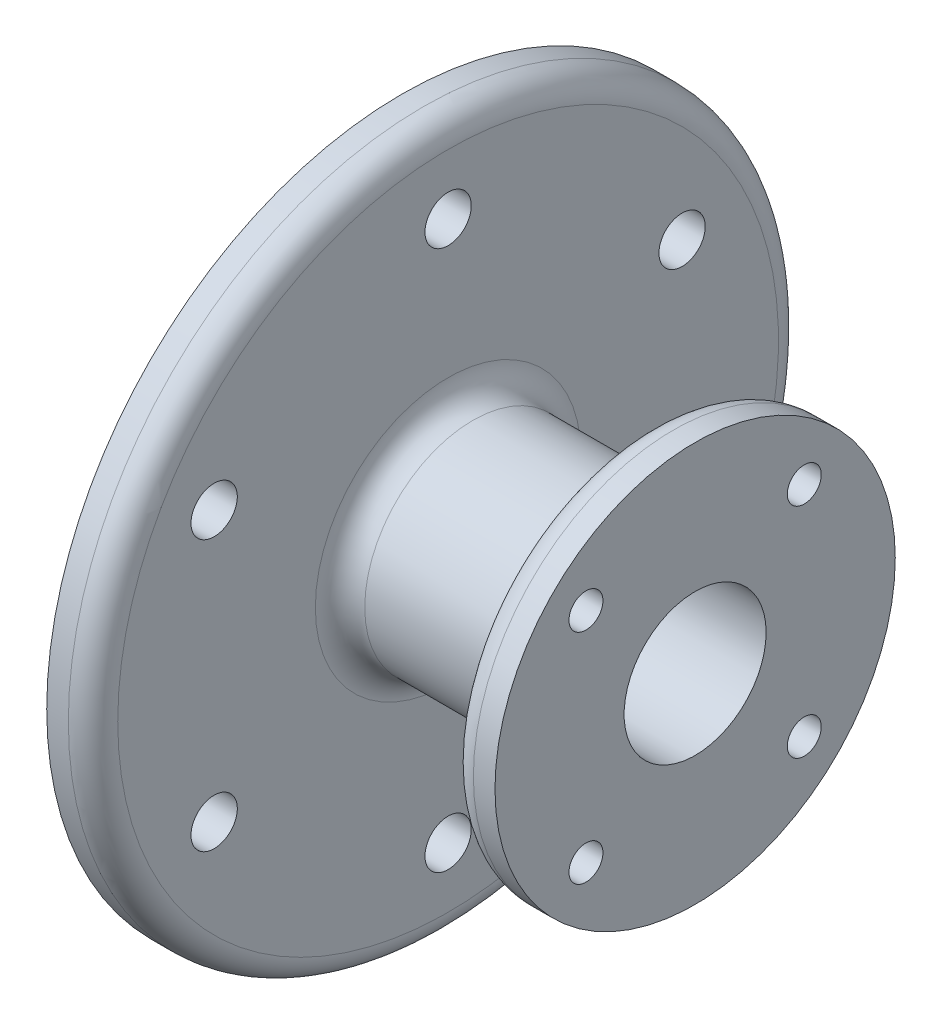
ISO-10303-21;
HEADER;
FILE_DESCRIPTION(('STEP AP214'),'2;1');
FILE_NAME('part.step','',(''),(''),'','','');
FILE_SCHEMA(('AUTOMOTIVE_DESIGN { 1 0 10303 214 1 1 1 1 }'));
ENDSEC;
DATA;
#1=APPLICATION_CONTEXT('core data for automotive mechanical design processes');
#2=APPLICATION_PROTOCOL_DEFINITION('international standard','automotive_design',2000,#1);
#3=PRODUCT_CONTEXT('',#1,'mechanical');
#4=PRODUCT('Part','Part','',(#3));
#5=PRODUCT_RELATED_PRODUCT_CATEGORY('part','',(#4));
#6=PRODUCT_DEFINITION_FORMATION('','',#4);
#7=PRODUCT_DEFINITION_CONTEXT('part definition',#1,'design');
#8=PRODUCT_DEFINITION('design','',#6,#7);
#9=PRODUCT_DEFINITION_SHAPE('','',#8);
#10=(LENGTH_UNIT() NAMED_UNIT(*) SI_UNIT(.MILLI.,.METRE.));
#11=(NAMED_UNIT(*) PLANE_ANGLE_UNIT() SI_UNIT($,.RADIAN.));
#12=(NAMED_UNIT(*) SI_UNIT($,.STERADIAN.) SOLID_ANGLE_UNIT());
#13=UNCERTAINTY_MEASURE_WITH_UNIT(LENGTH_MEASURE(1.E-05),#10,'distance_accuracy_value','');
#14=(GEOMETRIC_REPRESENTATION_CONTEXT(3) GLOBAL_UNCERTAINTY_ASSIGNED_CONTEXT((#13)) GLOBAL_UNIT_ASSIGNED_CONTEXT((#10,
#11,#12)) REPRESENTATION_CONTEXT('',''));
#15=CARTESIAN_POINT('',(0.,0.,0.));
#16=DIRECTION('',(0.,0.,1.));
#17=DIRECTION('',(1.,0.,0.));
#18=AXIS2_PLACEMENT_3D('',#15,#16,#17);
#19=CARTESIAN_POINT('',(-168.,-154.824455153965,0.));
#20=DIRECTION('',(1.,0.,0.));
#21=DIRECTION('',(0.,0.,-1.));
#22=AXIS2_PLACEMENT_3D('',#19,#20,#21);
#23=PLANE('',#22);
#24=CARTESIAN_POINT('',(-168.,-54.6446609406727,-35.3553390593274));
#25=DIRECTION('',(-1.,0.,0.));
#26=DIRECTION('',(0.,0.,1.));
#27=AXIS2_PLACEMENT_3D('',#24,#25,#26);
#28=CIRCLE('',#27,5.49999999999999);
#29=CARTESIAN_POINT('',(-168.,-54.6446609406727,-29.8553390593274));
#30=VERTEX_POINT('',#29);
#31=EDGE_CURVE('E102',#30,#30,#28,.T.);
#32=ORIENTED_EDGE('',*,*,#31,.F.);
#33=EDGE_LOOP('',(#32));
#34=FACE_BOUND('',#33,.T.);
#35=CARTESIAN_POINT('',(-168.,-54.6446609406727,35.3553390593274));
#36=DIRECTION('',(-1.,0.,0.));
#37=DIRECTION('',(0.,0.,1.));
#38=AXIS2_PLACEMENT_3D('',#35,#36,#37);
#39=CIRCLE('',#38,5.49999999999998);
#40=CARTESIAN_POINT('',(-168.,-54.6446609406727,40.8553390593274));
#41=VERTEX_POINT('',#40);
#42=EDGE_CURVE('E96',#41,#41,#39,.T.);
#43=ORIENTED_EDGE('',*,*,#42,.F.);
#44=EDGE_LOOP('',(#43));
#45=FACE_BOUND('',#44,.T.);
#46=CARTESIAN_POINT('',(-168.,-125.355339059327,35.3553390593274));
#47=DIRECTION('',(-1.,0.,0.));
#48=DIRECTION('',(0.,0.,1.));
#49=AXIS2_PLACEMENT_3D('',#46,#47,#48);
#50=CIRCLE('',#49,5.49999999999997);
#51=CARTESIAN_POINT('',(-168.,-125.355339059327,40.8553390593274));
#52=VERTEX_POINT('',#51);
#53=EDGE_CURVE('E90',#52,#52,#50,.T.);
#54=ORIENTED_EDGE('',*,*,#53,.F.);
#55=EDGE_LOOP('',(#54));
#56=FACE_BOUND('',#55,.T.);
#57=CARTESIAN_POINT('',(-168.,-125.355339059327,-35.3553390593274));
#58=DIRECTION('',(-1.,0.,0.));
#59=DIRECTION('',(0.,0.,1.));
#60=AXIS2_PLACEMENT_3D('',#57,#58,#59);
#61=CIRCLE('',#60,5.49999999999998);
#62=CARTESIAN_POINT('',(-168.,-125.355339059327,-29.8553390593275));
#63=VERTEX_POINT('',#62);
#64=EDGE_CURVE('E84',#63,#63,#61,.T.);
#65=ORIENTED_EDGE('',*,*,#64,.F.);
#66=EDGE_LOOP('',(#65));
#67=FACE_BOUND('',#66,.T.);
#68=CARTESIAN_POINT('',(-168.,-90.,0.));
#69=DIRECTION('',(1.,0.,0.));
#70=DIRECTION('',(0.,0.,-1.));
#71=AXIS2_PLACEMENT_3D('',#68,#69,#70);
#72=CIRCLE('',#71,43.);
#73=CARTESIAN_POINT('',(-168.,-90.,-43.));
#74=VERTEX_POINT('',#73);
#75=EDGE_CURVE('E43',#74,#74,#72,.T.);
#76=ORIENTED_EDGE('',*,*,#75,.T.);
#77=EDGE_LOOP('',(#76));
#78=FACE_BOUND('',#77,.T.);
#79=CARTESIAN_POINT('',(-168.,-90.,0.));
#80=DIRECTION('',(1.,0.,0.));
#81=DIRECTION('',(0.,0.,-1.));
#82=AXIS2_PLACEMENT_3D('',#79,#80,#81);
#83=CIRCLE('',#82,56.8244551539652);
#84=CARTESIAN_POINT('',(-168.,-90.,-56.8244551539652));
#85=VERTEX_POINT('',#84);
#86=EDGE_CURVE('E48',#85,#85,#83,.F.);
#87=ORIENTED_EDGE('',*,*,#86,.T.);
#88=EDGE_LOOP('',(#87));
#89=FACE_BOUND('',#88,.T.);
#90=ADVANCED_FACE('F28',(#34,#45,#56,#67,#78,#89),#23,.F.);
#91=CARTESIAN_POINT('',(-121.019521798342,-90.,0.));
#92=DIRECTION('',(1.,0.,0.));
#93=DIRECTION('',(0.,0.,-1.));
#94=AXIS2_PLACEMENT_3D('',#91,#92,#93);
#95=CYLINDRICAL_SURFACE('',#94,64.8244551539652);
#96=CARTESIAN_POINT('',(-160.,-90.,0.));
#97=DIRECTION('',(1.,0.,0.));
#98=DIRECTION('',(0.,0.,-1.));
#99=AXIS2_PLACEMENT_3D('',#96,#97,#98);
#100=CIRCLE('',#99,64.8244551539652);
#101=CARTESIAN_POINT('',(-160.,-90.,-64.8244551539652));
#102=VERTEX_POINT('',#101);
#103=EDGE_CURVE('E39',#102,#102,#100,.T.);
#104=ORIENTED_EDGE('',*,*,#103,.T.);
#105=EDGE_LOOP('',(#104));
#106=FACE_BOUND('',#105,.T.);
#107=CARTESIAN_POINT('',(-153.,-90.,0.));
#108=DIRECTION('',(1.,0.,0.));
#109=DIRECTION('',(0.,0.,-1.));
#110=AXIS2_PLACEMENT_3D('',#107,#108,#109);
#111=CIRCLE('',#110,64.8244551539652);
#112=CARTESIAN_POINT('',(-153.,-90.,-64.8244551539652));
#113=VERTEX_POINT('',#112);
#114=EDGE_CURVE('E66',#113,#113,#111,.T.);
#115=ORIENTED_EDGE('',*,*,#114,.F.);
#116=EDGE_LOOP('',(#115));
#117=FACE_BOUND('',#116,.T.);
#118=ADVANCED_FACE('F174',(#106,#117),#95,.T.);
#119=CARTESIAN_POINT('',(-153.,-113.,0.));
#120=DIRECTION('',(-1.,0.,0.));
#121=DIRECTION('',(0.,0.,1.));
#122=AXIS2_PLACEMENT_3D('',#119,#120,#121);
#123=PLANE('',#122);
#124=CARTESIAN_POINT('',(-153.,-54.6446609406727,-35.3553390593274));
#125=DIRECTION('',(-1.,0.,0.));
#126=DIRECTION('',(0.,0.,1.));
#127=AXIS2_PLACEMENT_3D('',#124,#125,#126);
#128=CIRCLE('',#127,5.49999999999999);
#129=CARTESIAN_POINT('',(-153.,-54.6446609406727,-29.8553390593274));
#130=VERTEX_POINT('',#129);
#131=EDGE_CURVE('E99',#130,#130,#128,.F.);
#132=ORIENTED_EDGE('',*,*,#131,.F.);
#133=EDGE_LOOP('',(#132));
#134=FACE_BOUND('',#133,.T.);
#135=CARTESIAN_POINT('',(-153.,-54.6446609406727,35.3553390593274));
#136=DIRECTION('',(-1.,0.,0.));
#137=DIRECTION('',(0.,0.,1.));
#138=AXIS2_PLACEMENT_3D('',#135,#136,#137);
#139=CIRCLE('',#138,5.49999999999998);
#140=CARTESIAN_POINT('',(-153.,-54.6446609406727,40.8553390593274));
#141=VERTEX_POINT('',#140);
#142=EDGE_CURVE('E93',#141,#141,#139,.F.);
#143=ORIENTED_EDGE('',*,*,#142,.F.);
#144=EDGE_LOOP('',(#143));
#145=FACE_BOUND('',#144,.T.);
#146=CARTESIAN_POINT('',(-153.,-125.355339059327,35.3553390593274));
#147=DIRECTION('',(-1.,0.,0.));
#148=DIRECTION('',(0.,0.,1.));
#149=AXIS2_PLACEMENT_3D('',#146,#147,#148);
#150=CIRCLE('',#149,5.49999999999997);
#151=CARTESIAN_POINT('',(-153.,-125.355339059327,40.8553390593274));
#152=VERTEX_POINT('',#151);
#153=EDGE_CURVE('E87',#152,#152,#150,.F.);
#154=ORIENTED_EDGE('',*,*,#153,.F.);
#155=EDGE_LOOP('',(#154));
#156=FACE_BOUND('',#155,.T.);
#157=CARTESIAN_POINT('',(-153.,-125.355339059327,-35.3553390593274));
#158=DIRECTION('',(-1.,0.,0.));
#159=DIRECTION('',(0.,0.,1.));
#160=AXIS2_PLACEMENT_3D('',#157,#158,#159);
#161=CIRCLE('',#160,5.49999999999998);
#162=CARTESIAN_POINT('',(-153.,-125.355339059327,-29.8553390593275));
#163=VERTEX_POINT('',#162);
#164=EDGE_CURVE('E81',#163,#163,#161,.F.);
#165=ORIENTED_EDGE('',*,*,#164,.F.);
#166=EDGE_LOOP('',(#165));
#167=FACE_BOUND('',#166,.T.);
#168=CARTESIAN_POINT('',(-153.,-90.,0.));
#169=DIRECTION('',(1.,0.,0.));
#170=DIRECTION('',(0.,0.,-1.));
#171=AXIS2_PLACEMENT_3D('',#168,#169,#170);
#172=CIRCLE('',#171,23.);
#173=CARTESIAN_POINT('',(-153.,-90.,-23.));
#174=VERTEX_POINT('',#173);
#175=EDGE_CURVE('E69',#174,#174,#172,.T.);
#176=ORIENTED_EDGE('',*,*,#175,.F.);
#177=EDGE_LOOP('',(#176));
#178=FACE_BOUND('',#177,.T.);
#179=ORIENTED_EDGE('',*,*,#114,.T.);
#180=EDGE_LOOP('',(#179));
#181=FACE_BOUND('',#180,.T.);
#182=ADVANCED_FACE('F180',(#134,#145,#156,#167,#178,#181),#123,.F.);
#183=CARTESIAN_POINT('',(-121.019521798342,-90.,0.));
#184=DIRECTION('',(1.,0.,0.));
#185=DIRECTION('',(0.,0.,-1.));
#186=AXIS2_PLACEMENT_3D('',#183,#184,#185);
#187=CYLINDRICAL_SURFACE('',#186,23.);
#188=CARTESIAN_POINT('',(-263.,-90.,0.));
#189=DIRECTION('',(1.,0.,0.));
#190=DIRECTION('',(0.,0.,-1.));
#191=AXIS2_PLACEMENT_3D('',#188,#189,#190);
#192=CIRCLE('',#191,23.);
#193=CARTESIAN_POINT('',(-263.,-90.,-23.));
#194=VERTEX_POINT('',#193);
#195=EDGE_CURVE('E72',#194,#194,#192,.T.);
#196=ORIENTED_EDGE('',*,*,#195,.F.);
#197=EDGE_LOOP('',(#196));
#198=FACE_BOUND('',#197,.T.);
#199=ORIENTED_EDGE('',*,*,#175,.T.);
#200=EDGE_LOOP('',(#199));
#201=FACE_BOUND('',#200,.T.);
#202=ADVANCED_FACE('F171',(#198,#201),#187,.F.);
#203=CARTESIAN_POINT('',(-263.,-113.,0.));
#204=DIRECTION('',(1.,0.,0.));
#205=DIRECTION('',(0.,0.,-1.));
#206=AXIS2_PLACEMENT_3D('',#203,#204,#205);
#207=PLANE('',#206);
#208=CARTESIAN_POINT('',(-263.,-90.,0.));
#209=DIRECTION('',(1.,0.,0.));
#210=DIRECTION('',(0.,0.,-1.));
#211=AXIS2_PLACEMENT_3D('',#208,#209,#210);
#212=CIRCLE('',#211,28.);
#213=CARTESIAN_POINT('',(-263.,-90.,-28.));
#214=VERTEX_POINT('',#213);
#215=EDGE_CURVE('E10',#214,#214,#212,.F.);
#216=ORIENTED_EDGE('',*,*,#215,.T.);
#217=EDGE_LOOP('',(#216));
#218=FACE_BOUND('',#217,.T.);
#219=ORIENTED_EDGE('',*,*,#195,.T.);
#220=EDGE_LOOP('',(#219));
#221=FACE_BOUND('',#220,.T.);
#222=ADVANCED_FACE('F166',(#218,#221),#207,.F.);
#223=CARTESIAN_POINT('',(-121.019521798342,-90.,0.));
#224=DIRECTION('',(1.,0.,0.));
#225=DIRECTION('',(0.,0.,-1.));
#226=AXIS2_PLACEMENT_3D('',#223,#224,#225);
#227=CYLINDRICAL_SURFACE('',#226,31.);
#228=CARTESIAN_POINT('',(-260.,-90.,0.));
#229=DIRECTION('',(1.,0.,0.));
#230=DIRECTION('',(0.,0.,-1.));
#231=AXIS2_PLACEMENT_3D('',#228,#229,#230);
#232=CIRCLE('',#231,31.);
#233=CARTESIAN_POINT('',(-260.,-90.,-31.));
#234=VERTEX_POINT('',#233);
#235=EDGE_CURVE('E35',#234,#234,#232,.T.);
#236=ORIENTED_EDGE('',*,*,#235,.T.);
#237=EDGE_LOOP('',(#236));
#238=FACE_BOUND('',#237,.T.);
#239=CARTESIAN_POINT('',(-248.,-90.,0.));
#240=DIRECTION('',(1.,0.,0.));
#241=DIRECTION('',(0.,0.,-1.));
#242=AXIS2_PLACEMENT_3D('',#239,#240,#241);
#243=CIRCLE('',#242,31.);
#244=CARTESIAN_POINT('',(-248.,-90.,-31.));
#245=VERTEX_POINT('',#244);
#246=EDGE_CURVE('E75',#245,#245,#243,.T.);
#247=ORIENTED_EDGE('',*,*,#246,.F.);
#248=EDGE_LOOP('',(#247));
#249=FACE_BOUND('',#248,.T.);
#250=ADVANCED_FACE('F149',(#238,#249),#227,.T.);
#251=CARTESIAN_POINT('',(-248.,-205.,0.));
#252=DIRECTION('',(1.,0.,0.));
#253=DIRECTION('',(0.,0.,-1.));
#254=AXIS2_PLACEMENT_3D('',#251,#252,#253);
#255=PLANE('',#254);
#256=CARTESIAN_POINT('',(-248.,-46.2499999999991,-75.7772228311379));
#257=DIRECTION('',(-1.,0.,0.));
#258=DIRECTION('',(0.,0.866025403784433,0.50000000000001));
#259=AXIS2_PLACEMENT_3D('',#256,#257,#258);
#260=CIRCLE('',#259,7.5);
#261=CARTESIAN_POINT('',(-248.,-39.7548094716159,-72.0272228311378));
#262=VERTEX_POINT('',#261);
#263=EDGE_CURVE('E138',#262,#262,#260,.T.);
#264=ORIENTED_EDGE('',*,*,#263,.F.);
#265=EDGE_LOOP('',(#264));
#266=FACE_BOUND('',#265,.T.);
#267=CARTESIAN_POINT('',(-248.,-133.749999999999,-75.7772228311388));
#268=DIRECTION('',(-1.,0.,0.));
#269=DIRECTION('',(0.,0.866025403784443,-0.499999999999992));
#270=AXIS2_PLACEMENT_3D('',#267,#268,#269);
#271=CIRCLE('',#270,7.5);
#272=CARTESIAN_POINT('',(-248.,-127.254809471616,-79.5272228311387));
#273=VERTEX_POINT('',#272);
#274=EDGE_CURVE('E132',#273,#273,#271,.T.);
#275=ORIENTED_EDGE('',*,*,#274,.F.);
#276=EDGE_LOOP('',(#275));
#277=FACE_BOUND('',#276,.T.);
#278=CARTESIAN_POINT('',(-248.,-177.5,-6.11009588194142E-13));
#279=DIRECTION('',(-1.,0.,0.));
#280=DIRECTION('',(0.,0.,-1.));
#281=AXIS2_PLACEMENT_3D('',#278,#279,#280);
#282=CIRCLE('',#281,7.5);
#283=CARTESIAN_POINT('',(-248.,-177.5,-7.50000000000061));
#284=VERTEX_POINT('',#283);
#285=EDGE_CURVE('E126',#284,#284,#282,.T.);
#286=ORIENTED_EDGE('',*,*,#285,.F.);
#287=EDGE_LOOP('',(#286));
#288=FACE_BOUND('',#287,.T.);
#289=CARTESIAN_POINT('',(-248.,-133.75,75.7772228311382));
#290=DIRECTION('',(-1.,0.,0.));
#291=DIRECTION('',(0.,-0.866025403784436,-0.500000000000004));
#292=AXIS2_PLACEMENT_3D('',#289,#290,#291);
#293=CIRCLE('',#292,7.5);
#294=CARTESIAN_POINT('',(-248.,-140.245190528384,72.0272228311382));
#295=VERTEX_POINT('',#294);
#296=EDGE_CURVE('E120',#295,#295,#293,.T.);
#297=ORIENTED_EDGE('',*,*,#296,.F.);
#298=EDGE_LOOP('',(#297));
#299=FACE_BOUND('',#298,.T.);
#300=CARTESIAN_POINT('',(-248.,-46.2500000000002,75.7772228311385));
#301=DIRECTION('',(-1.,0.,0.));
#302=DIRECTION('',(0.,-0.86602540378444,0.499999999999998));
#303=AXIS2_PLACEMENT_3D('',#300,#301,#302);
#304=CIRCLE('',#303,7.5);
#305=CARTESIAN_POINT('',(-248.,-52.7451905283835,79.5272228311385));
#306=VERTEX_POINT('',#305);
#307=EDGE_CURVE('E114',#306,#306,#304,.T.);
#308=ORIENTED_EDGE('',*,*,#307,.F.);
#309=EDGE_LOOP('',(#308));
#310=FACE_BOUND('',#309,.T.);
#311=CARTESIAN_POINT('',(-248.,-2.5,0.));
#312=DIRECTION('',(-1.,0.,0.));
#313=DIRECTION('',(0.,0.,1.));
#314=AXIS2_PLACEMENT_3D('',#311,#312,#313);
#315=CIRCLE('',#314,7.5);
#316=CARTESIAN_POINT('',(-248.,-2.5,7.5));
#317=VERTEX_POINT('',#316);
#318=EDGE_CURVE('E108',#317,#317,#315,.T.);
#319=ORIENTED_EDGE('',*,*,#318,.F.);
#320=EDGE_LOOP('',(#319));
#321=FACE_BOUND('',#320,.T.);
#322=CARTESIAN_POINT('',(-248.,-90.,0.));
#323=DIRECTION('',(1.,0.,0.));
#324=DIRECTION('',(0.,0.,-1.));
#325=AXIS2_PLACEMENT_3D('',#322,#323,#324);
#326=CIRCLE('',#325,115.);
#327=CARTESIAN_POINT('',(-248.,-90.,-115.));
#328=VERTEX_POINT('',#327);
#329=EDGE_CURVE('E78',#328,#328,#326,.T.);
#330=ORIENTED_EDGE('',*,*,#329,.F.);
#331=EDGE_LOOP('',(#330));
#332=FACE_BOUND('',#331,.T.);
#333=ORIENTED_EDGE('',*,*,#246,.T.);
#334=EDGE_LOOP('',(#333));
#335=FACE_BOUND('',#334,.T.);
#336=ADVANCED_FACE('F145',(#266,#277,#288,#299,#310,#321,#332,#335),#255,.F.);
#337=CARTESIAN_POINT('',(-121.019521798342,-90.,0.));
#338=DIRECTION('',(1.,0.,0.));
#339=DIRECTION('',(0.,0.,-1.));
#340=AXIS2_PLACEMENT_3D('',#337,#338,#339);
#341=CYLINDRICAL_SURFACE('',#340,115.);
#342=CARTESIAN_POINT('',(-241.,-90.,0.));
#343=DIRECTION('',(-1.,0.,0.));
#344=DIRECTION('',(0.,0.,1.));
#345=AXIS2_PLACEMENT_3D('',#342,#343,#344);
#346=CIRCLE('',#345,115.);
#347=CARTESIAN_POINT('',(-241.,-90.,115.));
#348=VERTEX_POINT('',#347);
#349=EDGE_CURVE('E57',#348,#348,#346,.T.);
#350=ORIENTED_EDGE('',*,*,#349,.T.);
#351=EDGE_LOOP('',(#350));
#352=FACE_BOUND('',#351,.T.);
#353=ORIENTED_EDGE('',*,*,#329,.T.);
#354=EDGE_LOOP('',(#353));
#355=FACE_BOUND('',#354,.T.);
#356=ADVANCED_FACE('F148',(#352,#355),#341,.T.);
#357=CARTESIAN_POINT('',(-233.,-125.,0.));
#358=DIRECTION('',(-1.,0.,0.));
#359=DIRECTION('',(0.,0.,1.));
#360=AXIS2_PLACEMENT_3D('',#357,#358,#359);
#361=PLANE('',#360);
#362=CARTESIAN_POINT('',(-233.,-46.2499999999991,-75.7772228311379));
#363=DIRECTION('',(-1.,0.,0.));
#364=DIRECTION('',(0.,0.,1.));
#365=AXIS2_PLACEMENT_3D('',#362,#363,#364);
#366=CIRCLE('',#365,7.5);
#367=CARTESIAN_POINT('',(-233.,-46.2499999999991,-68.2772228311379));
#368=VERTEX_POINT('',#367);
#369=EDGE_CURVE('E135',#368,#368,#366,.F.);
#370=ORIENTED_EDGE('',*,*,#369,.F.);
#371=EDGE_LOOP('',(#370));
#372=FACE_BOUND('',#371,.T.);
#373=CARTESIAN_POINT('',(-233.,-133.749999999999,-75.7772228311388));
#374=DIRECTION('',(-1.,0.,0.));
#375=DIRECTION('',(0.,0.,1.));
#376=AXIS2_PLACEMENT_3D('',#373,#374,#375);
#377=CIRCLE('',#376,7.5);
#378=CARTESIAN_POINT('',(-233.,-133.749999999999,-68.2772228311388));
#379=VERTEX_POINT('',#378);
#380=EDGE_CURVE('E129',#379,#379,#377,.F.);
#381=ORIENTED_EDGE('',*,*,#380,.F.);
#382=EDGE_LOOP('',(#381));
#383=FACE_BOUND('',#382,.T.);
#384=CARTESIAN_POINT('',(-233.,-177.5,-6.11009588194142E-13));
#385=DIRECTION('',(-1.,0.,0.));
#386=DIRECTION('',(0.,0.,1.));
#387=AXIS2_PLACEMENT_3D('',#384,#385,#386);
#388=CIRCLE('',#387,7.5);
#389=CARTESIAN_POINT('',(-233.,-177.5,7.49999999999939));
#390=VERTEX_POINT('',#389);
#391=EDGE_CURVE('E123',#390,#390,#388,.F.);
#392=ORIENTED_EDGE('',*,*,#391,.F.);
#393=EDGE_LOOP('',(#392));
#394=FACE_BOUND('',#393,.T.);
#395=CARTESIAN_POINT('',(-233.,-133.75,75.7772228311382));
#396=DIRECTION('',(-1.,0.,0.));
#397=DIRECTION('',(0.,0.,1.));
#398=AXIS2_PLACEMENT_3D('',#395,#396,#397);
#399=CIRCLE('',#398,7.5);
#400=CARTESIAN_POINT('',(-233.,-133.75,83.2772228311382));
#401=VERTEX_POINT('',#400);
#402=EDGE_CURVE('E117',#401,#401,#399,.F.);
#403=ORIENTED_EDGE('',*,*,#402,.F.);
#404=EDGE_LOOP('',(#403));
#405=FACE_BOUND('',#404,.T.);
#406=CARTESIAN_POINT('',(-233.,-46.2500000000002,75.7772228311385));
#407=DIRECTION('',(-1.,0.,0.));
#408=DIRECTION('',(0.,0.,1.));
#409=AXIS2_PLACEMENT_3D('',#406,#407,#408);
#410=CIRCLE('',#409,7.5);
#411=CARTESIAN_POINT('',(-233.,-46.2500000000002,83.2772228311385));
#412=VERTEX_POINT('',#411);
#413=EDGE_CURVE('E111',#412,#412,#410,.F.);
#414=ORIENTED_EDGE('',*,*,#413,.F.);
#415=EDGE_LOOP('',(#414));
#416=FACE_BOUND('',#415,.T.);
#417=CARTESIAN_POINT('',(-233.,-2.5,0.));
#418=DIRECTION('',(-1.,0.,0.));
#419=DIRECTION('',(0.,0.,1.));
#420=AXIS2_PLACEMENT_3D('',#417,#418,#419);
#421=CIRCLE('',#420,7.5);
#422=CARTESIAN_POINT('',(-233.,-2.5,7.5));
#423=VERTEX_POINT('',#422);
#424=EDGE_CURVE('E105',#423,#423,#421,.F.);
#425=ORIENTED_EDGE('',*,*,#424,.F.);
#426=EDGE_LOOP('',(#425));
#427=FACE_BOUND('',#426,.T.);
#428=CARTESIAN_POINT('',(-233.,-90.,0.));
#429=DIRECTION('',(-1.,0.,0.));
#430=DIRECTION('',(0.,0.,1.));
#431=AXIS2_PLACEMENT_3D('',#428,#429,#430);
#432=CIRCLE('',#431,107.);
#433=CARTESIAN_POINT('',(-233.,-90.,107.));
#434=VERTEX_POINT('',#433);
#435=EDGE_CURVE('E60',#434,#434,#432,.F.);
#436=ORIENTED_EDGE('',*,*,#435,.T.);
#437=EDGE_LOOP('',(#436));
#438=FACE_BOUND('',#437,.T.);
#439=CARTESIAN_POINT('',(-233.,-90.,0.));
#440=DIRECTION('',(-1.,0.,0.));
#441=DIRECTION('',(0.,0.,1.));
#442=AXIS2_PLACEMENT_3D('',#439,#440,#441);
#443=CIRCLE('',#442,43.);
#444=CARTESIAN_POINT('',(-233.,-90.,43.));
#445=VERTEX_POINT('',#444);
#446=EDGE_CURVE('E63',#445,#445,#443,.T.);
#447=ORIENTED_EDGE('',*,*,#446,.T.);
#448=EDGE_LOOP('',(#447));
#449=FACE_BOUND('',#448,.T.);
#450=ADVANCED_FACE('F248',(#372,#383,#394,#405,#416,#427,#438,#449),#361,.F.);
#451=CARTESIAN_POINT('',(-121.019521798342,-90.,0.));
#452=DIRECTION('',(1.,0.,0.));
#453=DIRECTION('',(0.,0.,-1.));
#454=AXIS2_PLACEMENT_3D('',#451,#452,#453);
#455=CYLINDRICAL_SURFACE('',#454,35.);
#456=CARTESIAN_POINT('',(-225.,-90.,0.));
#457=DIRECTION('',(-1.,0.,0.));
#458=DIRECTION('',(0.,0.,1.));
#459=AXIS2_PLACEMENT_3D('',#456,#457,#458);
#460=CIRCLE('',#459,35.);
#461=CARTESIAN_POINT('',(-225.,-90.,35.));
#462=VERTEX_POINT('',#461);
#463=EDGE_CURVE('E51',#462,#462,#460,.F.);
#464=ORIENTED_EDGE('',*,*,#463,.T.);
#465=EDGE_LOOP('',(#464));
#466=FACE_BOUND('',#465,.T.);
#467=CARTESIAN_POINT('',(-176.,-90.,0.));
#468=DIRECTION('',(1.,0.,0.));
#469=DIRECTION('',(0.,0.,-1.));
#470=AXIS2_PLACEMENT_3D('',#467,#468,#469);
#471=CIRCLE('',#470,35.);
#472=CARTESIAN_POINT('',(-176.,-90.,-35.));
#473=VERTEX_POINT('',#472);
#474=EDGE_CURVE('E54',#473,#473,#471,.F.);
#475=ORIENTED_EDGE('',*,*,#474,.T.);
#476=EDGE_LOOP('',(#475));
#477=FACE_BOUND('',#476,.T.);
#478=ADVANCED_FACE('F191',(#466,#477),#455,.T.);
#479=CARTESIAN_POINT('',(-241.,-90.,0.));
#480=DIRECTION('',(-1.,0.,0.));
#481=DIRECTION('',(0.,0.,1.));
#482=AXIS2_PLACEMENT_3D('',#479,#480,#481);
#483=TOROIDAL_SURFACE('',#482,107.,8.);
#484=ORIENTED_EDGE('',*,*,#349,.F.);
#485=EDGE_LOOP('',(#484));
#486=FACE_BOUND('',#485,.T.);
#487=ORIENTED_EDGE('',*,*,#435,.F.);
#488=EDGE_LOOP('',(#487));
#489=FACE_BOUND('',#488,.T.);
#490=ADVANCED_FACE('F187',(#486,#489),#483,.T.);
#491=CARTESIAN_POINT('',(-225.,-90.,0.));
#492=DIRECTION('',(-1.,0.,0.));
#493=DIRECTION('',(0.,0.,1.));
#494=AXIS2_PLACEMENT_3D('',#491,#492,#493);
#495=TOROIDAL_SURFACE('',#494,43.,8.);
#496=ORIENTED_EDGE('',*,*,#446,.F.);
#497=EDGE_LOOP('',(#496));
#498=FACE_BOUND('',#497,.T.);
#499=ORIENTED_EDGE('',*,*,#463,.F.);
#500=EDGE_LOOP('',(#499));
#501=FACE_BOUND('',#500,.T.);
#502=ADVANCED_FACE('F190',(#498,#501),#495,.F.);
#503=CARTESIAN_POINT('',(-176.,-90.,0.));
#504=DIRECTION('',(1.,0.,0.));
#505=DIRECTION('',(0.,0.,-1.));
#506=AXIS2_PLACEMENT_3D('',#503,#504,#505);
#507=TOROIDAL_SURFACE('',#506,43.,8.);
#508=ORIENTED_EDGE('',*,*,#474,.F.);
#509=EDGE_LOOP('',(#508));
#510=FACE_BOUND('',#509,.T.);
#511=ORIENTED_EDGE('',*,*,#75,.F.);
#512=EDGE_LOOP('',(#511));
#513=FACE_BOUND('',#512,.T.);
#514=ADVANCED_FACE('F195',(#510,#513),#507,.F.);
#515=CARTESIAN_POINT('',(-160.,-90.,0.));
#516=DIRECTION('',(1.,0.,0.));
#517=DIRECTION('',(0.,0.,-1.));
#518=AXIS2_PLACEMENT_3D('',#515,#516,#517);
#519=TOROIDAL_SURFACE('',#518,56.8244551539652,8.);
#520=ORIENTED_EDGE('',*,*,#86,.F.);
#521=EDGE_LOOP('',(#520));
#522=FACE_BOUND('',#521,.T.);
#523=ORIENTED_EDGE('',*,*,#103,.F.);
#524=EDGE_LOOP('',(#523));
#525=FACE_BOUND('',#524,.T.);
#526=ADVANCED_FACE('F198',(#522,#525),#519,.T.);
#527=CARTESIAN_POINT('',(-152.999,-125.355339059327,-35.3553390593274));
#528=DIRECTION('',(-1.,0.,0.));
#529=DIRECTION('',(0.,0.,1.));
#530=AXIS2_PLACEMENT_3D('',#527,#528,#529);
#531=CYLINDRICAL_SURFACE('',#530,5.49999999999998);
#532=CARTESIAN_POINT('',(-168.,-125.355339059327,-29.8553390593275));
#533=CARTESIAN_POINT('',(-167.84375,-125.355339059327,-29.8553390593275));
#534=CARTESIAN_POINT('',(-167.6875,-125.355339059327,-29.8553390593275));
#535=CARTESIAN_POINT('',(-167.375,-125.355339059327,-29.8553390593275));
#536=CARTESIAN_POINT('',(-167.21875,-125.355339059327,-29.8553390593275));
#537=CARTESIAN_POINT('',(-166.90625,-125.355339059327,-29.8553390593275));
#538=CARTESIAN_POINT('',(-166.75,-125.355339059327,-29.8553390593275));
#539=CARTESIAN_POINT('',(-166.4375,-125.355339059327,-29.8553390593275));
#540=CARTESIAN_POINT('',(-166.28125,-125.355339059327,-29.8553390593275));
#541=CARTESIAN_POINT('',(-165.96875,-125.355339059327,-29.8553390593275));
#542=CARTESIAN_POINT('',(-165.8125,-125.355339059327,-29.8553390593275));
#543=CARTESIAN_POINT('',(-165.5,-125.355339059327,-29.8553390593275));
#544=CARTESIAN_POINT('',(-165.34375,-125.355339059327,-29.8553390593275));
#545=CARTESIAN_POINT('',(-165.03125,-125.355339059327,-29.8553390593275));
#546=CARTESIAN_POINT('',(-164.875,-125.355339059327,-29.8553390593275));
#547=CARTESIAN_POINT('',(-164.5625,-125.355339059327,-29.8553390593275));
#548=CARTESIAN_POINT('',(-164.40625,-125.355339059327,-29.8553390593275));
#549=CARTESIAN_POINT('',(-164.09375,-125.355339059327,-29.8553390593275));
#550=CARTESIAN_POINT('',(-163.9375,-125.355339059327,-29.8553390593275));
#551=CARTESIAN_POINT('',(-163.625,-125.355339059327,-29.8553390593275));
#552=CARTESIAN_POINT('',(-163.46875,-125.355339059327,-29.8553390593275));
#553=CARTESIAN_POINT('',(-163.15625,-125.355339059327,-29.8553390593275));
#554=CARTESIAN_POINT('',(-163.,-125.355339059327,-29.8553390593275));
#555=CARTESIAN_POINT('',(-162.6875,-125.355339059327,-29.8553390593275));
#556=CARTESIAN_POINT('',(-162.53125,-125.355339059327,-29.8553390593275));
#557=CARTESIAN_POINT('',(-162.21875,-125.355339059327,-29.8553390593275));
#558=CARTESIAN_POINT('',(-162.0625,-125.355339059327,-29.8553390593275));
#559=CARTESIAN_POINT('',(-161.75,-125.355339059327,-29.8553390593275));
#560=CARTESIAN_POINT('',(-161.59375,-125.355339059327,-29.8553390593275));
#561=CARTESIAN_POINT('',(-161.28125,-125.355339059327,-29.8553390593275));
#562=CARTESIAN_POINT('',(-161.125,-125.355339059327,-29.8553390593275));
#563=CARTESIAN_POINT('',(-160.8125,-125.355339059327,-29.8553390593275));
#564=CARTESIAN_POINT('',(-160.65625,-125.355339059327,-29.8553390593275));
#565=CARTESIAN_POINT('',(-160.34375,-125.355339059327,-29.8553390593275));
#566=CARTESIAN_POINT('',(-160.1875,-125.355339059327,-29.8553390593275));
#567=CARTESIAN_POINT('',(-159.875,-125.355339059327,-29.8553390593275));
#568=CARTESIAN_POINT('',(-159.71875,-125.355339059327,-29.8553390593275));
#569=CARTESIAN_POINT('',(-159.40625,-125.355339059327,-29.8553390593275));
#570=CARTESIAN_POINT('',(-159.25,-125.355339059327,-29.8553390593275));
#571=CARTESIAN_POINT('',(-158.9375,-125.355339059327,-29.8553390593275));
#572=CARTESIAN_POINT('',(-158.78125,-125.355339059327,-29.8553390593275));
#573=CARTESIAN_POINT('',(-158.46875,-125.355339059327,-29.8553390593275));
#574=CARTESIAN_POINT('',(-158.3125,-125.355339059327,-29.8553390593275));
#575=CARTESIAN_POINT('',(-158.,-125.355339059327,-29.8553390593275));
#576=CARTESIAN_POINT('',(-157.84375,-125.355339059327,-29.8553390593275));
#577=CARTESIAN_POINT('',(-157.53125,-125.355339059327,-29.8553390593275));
#578=CARTESIAN_POINT('',(-157.375,-125.355339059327,-29.8553390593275));
#579=CARTESIAN_POINT('',(-157.0625,-125.355339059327,-29.8553390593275));
#580=CARTESIAN_POINT('',(-156.90625,-125.355339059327,-29.8553390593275));
#581=CARTESIAN_POINT('',(-156.59375,-125.355339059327,-29.8553390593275));
#582=CARTESIAN_POINT('',(-156.4375,-125.355339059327,-29.8553390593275));
#583=CARTESIAN_POINT('',(-156.125,-125.355339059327,-29.8553390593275));
#584=CARTESIAN_POINT('',(-155.96875,-125.355339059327,-29.8553390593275));
#585=CARTESIAN_POINT('',(-155.65625,-125.355339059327,-29.8553390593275));
#586=CARTESIAN_POINT('',(-155.5,-125.355339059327,-29.8553390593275));
#587=CARTESIAN_POINT('',(-155.1875,-125.355339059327,-29.8553390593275));
#588=CARTESIAN_POINT('',(-155.03125,-125.355339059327,-29.8553390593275));
#589=CARTESIAN_POINT('',(-154.71875,-125.355339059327,-29.8553390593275));
#590=CARTESIAN_POINT('',(-154.5625,-125.355339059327,-29.8553390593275));
#591=CARTESIAN_POINT('',(-154.25,-125.355339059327,-29.8553390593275));
#592=CARTESIAN_POINT('',(-154.09375,-125.355339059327,-29.8553390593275));
#593=CARTESIAN_POINT('',(-153.78125,-125.355339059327,-29.8553390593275));
#594=CARTESIAN_POINT('',(-153.625,-125.355339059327,-29.8553390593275));
#595=CARTESIAN_POINT('',(-153.3125,-125.355339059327,-29.8553390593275));
#596=CARTESIAN_POINT('',(-153.15625,-125.355339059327,-29.8553390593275));
#597=CARTESIAN_POINT('',(-153.,-125.355339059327,-29.8553390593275));
#598=B_SPLINE_CURVE_WITH_KNOTS('',3,(#532,#533,#534,#535,#536,#537,#538,#539,#540,#541,#542,
#543,#544,#545,#546,#547,#548,#549,#550,#551,#552,#553,#554,#555,#556,#557,#558,#559,#560,#561,
#562,#563,#564,#565,#566,#567,#568,#569,#570,#571,#572,#573,#574,#575,#576,#577,#578,#579,#580,
#581,#582,#583,#584,#585,#586,#587,#588,#589,#590,#591,#592,#593,#594,#595,#596,#597),
.UNSPECIFIED.,.F.,.F.,(4,2,2,2,2,2,2,2,2,2,2,2,2,2,2,2,2,2,2,2,2,2,2,2,2,2,2,2,2,2,2,2,4),(0.,
0.46874999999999,0.93749999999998,1.40625,1.87499999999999,2.34374999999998,2.8125,
3.28124999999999,3.74999999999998,4.21874999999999,4.68749999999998,5.15624999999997,
5.62499999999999,6.09374999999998,6.56249999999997,7.03124999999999,7.49999999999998,
7.96874999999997,8.43749999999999,8.90624999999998,9.37499999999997,9.84374999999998,10.3125,
10.78125,11.25,11.71875,12.1875,12.65625,13.125,13.59375,14.0625,14.53125,15.),.UNSPECIFIED.);
#599=EDGE_CURVE('BSEAM201',#63,#163,#598,.T.);
#600=ORIENTED_EDGE('',*,*,#64,.T.);
#601=ORIENTED_EDGE('',*,*,#164,.T.);
#602=ORIENTED_EDGE('',*,*,#599,.T.);
#603=ORIENTED_EDGE('',*,*,#599,.F.);
#604=EDGE_LOOP('',(#600,#602,#601,#603));
#605=FACE_BOUND('',#604,.T.);
#606=ADVANCED_FACE('F201',(#605),#531,.F.);
#607=CARTESIAN_POINT('',(-152.999,-125.355339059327,35.3553390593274));
#608=DIRECTION('',(-1.,0.,0.));
#609=DIRECTION('',(0.,0.,1.));
#610=AXIS2_PLACEMENT_3D('',#607,#608,#609);
#611=CYLINDRICAL_SURFACE('',#610,5.49999999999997);
#612=CARTESIAN_POINT('',(-168.,-125.355339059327,40.8553390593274));
#613=CARTESIAN_POINT('',(-167.84375,-125.355339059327,40.8553390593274));
#614=CARTESIAN_POINT('',(-167.6875,-125.355339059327,40.8553390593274));
#615=CARTESIAN_POINT('',(-167.375,-125.355339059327,40.8553390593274));
#616=CARTESIAN_POINT('',(-167.21875,-125.355339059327,40.8553390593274));
#617=CARTESIAN_POINT('',(-166.90625,-125.355339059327,40.8553390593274));
#618=CARTESIAN_POINT('',(-166.75,-125.355339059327,40.8553390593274));
#619=CARTESIAN_POINT('',(-166.4375,-125.355339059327,40.8553390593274));
#620=CARTESIAN_POINT('',(-166.28125,-125.355339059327,40.8553390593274));
#621=CARTESIAN_POINT('',(-165.96875,-125.355339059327,40.8553390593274));
#622=CARTESIAN_POINT('',(-165.8125,-125.355339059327,40.8553390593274));
#623=CARTESIAN_POINT('',(-165.5,-125.355339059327,40.8553390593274));
#624=CARTESIAN_POINT('',(-165.34375,-125.355339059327,40.8553390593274));
#625=CARTESIAN_POINT('',(-165.03125,-125.355339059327,40.8553390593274));
#626=CARTESIAN_POINT('',(-164.875,-125.355339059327,40.8553390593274));
#627=CARTESIAN_POINT('',(-164.5625,-125.355339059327,40.8553390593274));
#628=CARTESIAN_POINT('',(-164.40625,-125.355339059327,40.8553390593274));
#629=CARTESIAN_POINT('',(-164.09375,-125.355339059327,40.8553390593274));
#630=CARTESIAN_POINT('',(-163.9375,-125.355339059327,40.8553390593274));
#631=CARTESIAN_POINT('',(-163.625,-125.355339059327,40.8553390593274));
#632=CARTESIAN_POINT('',(-163.46875,-125.355339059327,40.8553390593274));
#633=CARTESIAN_POINT('',(-163.15625,-125.355339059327,40.8553390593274));
#634=CARTESIAN_POINT('',(-163.,-125.355339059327,40.8553390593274));
#635=CARTESIAN_POINT('',(-162.6875,-125.355339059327,40.8553390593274));
#636=CARTESIAN_POINT('',(-162.53125,-125.355339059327,40.8553390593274));
#637=CARTESIAN_POINT('',(-162.21875,-125.355339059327,40.8553390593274));
#638=CARTESIAN_POINT('',(-162.0625,-125.355339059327,40.8553390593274));
#639=CARTESIAN_POINT('',(-161.75,-125.355339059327,40.8553390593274));
#640=CARTESIAN_POINT('',(-161.59375,-125.355339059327,40.8553390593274));
#641=CARTESIAN_POINT('',(-161.28125,-125.355339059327,40.8553390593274));
#642=CARTESIAN_POINT('',(-161.125,-125.355339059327,40.8553390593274));
#643=CARTESIAN_POINT('',(-160.8125,-125.355339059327,40.8553390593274));
#644=CARTESIAN_POINT('',(-160.65625,-125.355339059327,40.8553390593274));
#645=CARTESIAN_POINT('',(-160.34375,-125.355339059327,40.8553390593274));
#646=CARTESIAN_POINT('',(-160.1875,-125.355339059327,40.8553390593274));
#647=CARTESIAN_POINT('',(-159.875,-125.355339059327,40.8553390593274));
#648=CARTESIAN_POINT('',(-159.71875,-125.355339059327,40.8553390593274));
#649=CARTESIAN_POINT('',(-159.40625,-125.355339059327,40.8553390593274));
#650=CARTESIAN_POINT('',(-159.25,-125.355339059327,40.8553390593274));
#651=CARTESIAN_POINT('',(-158.9375,-125.355339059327,40.8553390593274));
#652=CARTESIAN_POINT('',(-158.78125,-125.355339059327,40.8553390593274));
#653=CARTESIAN_POINT('',(-158.46875,-125.355339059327,40.8553390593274));
#654=CARTESIAN_POINT('',(-158.3125,-125.355339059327,40.8553390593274));
#655=CARTESIAN_POINT('',(-158.,-125.355339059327,40.8553390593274));
#656=CARTESIAN_POINT('',(-157.84375,-125.355339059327,40.8553390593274));
#657=CARTESIAN_POINT('',(-157.53125,-125.355339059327,40.8553390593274));
#658=CARTESIAN_POINT('',(-157.375,-125.355339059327,40.8553390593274));
#659=CARTESIAN_POINT('',(-157.0625,-125.355339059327,40.8553390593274));
#660=CARTESIAN_POINT('',(-156.90625,-125.355339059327,40.8553390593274));
#661=CARTESIAN_POINT('',(-156.59375,-125.355339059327,40.8553390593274));
#662=CARTESIAN_POINT('',(-156.4375,-125.355339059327,40.8553390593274));
#663=CARTESIAN_POINT('',(-156.125,-125.355339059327,40.8553390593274));
#664=CARTESIAN_POINT('',(-155.96875,-125.355339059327,40.8553390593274));
#665=CARTESIAN_POINT('',(-155.65625,-125.355339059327,40.8553390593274));
#666=CARTESIAN_POINT('',(-155.5,-125.355339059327,40.8553390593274));
#667=CARTESIAN_POINT('',(-155.1875,-125.355339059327,40.8553390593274));
#668=CARTESIAN_POINT('',(-155.03125,-125.355339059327,40.8553390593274));
#669=CARTESIAN_POINT('',(-154.71875,-125.355339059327,40.8553390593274));
#670=CARTESIAN_POINT('',(-154.5625,-125.355339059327,40.8553390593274));
#671=CARTESIAN_POINT('',(-154.25,-125.355339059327,40.8553390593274));
#672=CARTESIAN_POINT('',(-154.09375,-125.355339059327,40.8553390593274));
#673=CARTESIAN_POINT('',(-153.78125,-125.355339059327,40.8553390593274));
#674=CARTESIAN_POINT('',(-153.625,-125.355339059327,40.8553390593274));
#675=CARTESIAN_POINT('',(-153.3125,-125.355339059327,40.8553390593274));
#676=CARTESIAN_POINT('',(-153.15625,-125.355339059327,40.8553390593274));
#677=CARTESIAN_POINT('',(-153.,-125.355339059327,40.8553390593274));
#678=B_SPLINE_CURVE_WITH_KNOTS('',3,(#612,#613,#614,#615,#616,#617,#618,#619,#620,#621,#622,
#623,#624,#625,#626,#627,#628,#629,#630,#631,#632,#633,#634,#635,#636,#637,#638,#639,#640,#641,
#642,#643,#644,#645,#646,#647,#648,#649,#650,#651,#652,#653,#654,#655,#656,#657,#658,#659,#660,
#661,#662,#663,#664,#665,#666,#667,#668,#669,#670,#671,#672,#673,#674,#675,#676,#677),
.UNSPECIFIED.,.F.,.F.,(4,2,2,2,2,2,2,2,2,2,2,2,2,2,2,2,2,2,2,2,2,2,2,2,2,2,2,2,2,2,2,2,4),(0.,
0.46874999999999,0.93749999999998,1.40625,1.87499999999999,2.34374999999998,2.8125,
3.28124999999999,3.74999999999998,4.21874999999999,4.68749999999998,5.15624999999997,
5.62499999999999,6.09374999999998,6.56249999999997,7.03124999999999,7.49999999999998,
7.96874999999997,8.43749999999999,8.90624999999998,9.37499999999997,9.84374999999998,10.3125,
10.78125,11.25,11.71875,12.1875,12.65625,13.125,13.59375,14.0625,14.53125,15.),.UNSPECIFIED.);
#679=EDGE_CURVE('BSEAM206',#52,#152,#678,.T.);
#680=ORIENTED_EDGE('',*,*,#53,.T.);
#681=ORIENTED_EDGE('',*,*,#153,.T.);
#682=ORIENTED_EDGE('',*,*,#679,.T.);
#683=ORIENTED_EDGE('',*,*,#679,.F.);
#684=EDGE_LOOP('',(#680,#682,#681,#683));
#685=FACE_BOUND('',#684,.T.);
#686=ADVANCED_FACE('F206',(#685),#611,.F.);
#687=CARTESIAN_POINT('',(-152.999,-54.6446609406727,35.3553390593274));
#688=DIRECTION('',(-1.,0.,0.));
#689=DIRECTION('',(0.,0.,1.));
#690=AXIS2_PLACEMENT_3D('',#687,#688,#689);
#691=CYLINDRICAL_SURFACE('',#690,5.49999999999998);
#692=CARTESIAN_POINT('',(-168.,-54.6446609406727,40.8553390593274));
#693=CARTESIAN_POINT('',(-167.84375,-54.6446609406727,40.8553390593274));
#694=CARTESIAN_POINT('',(-167.6875,-54.6446609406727,40.8553390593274));
#695=CARTESIAN_POINT('',(-167.375,-54.6446609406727,40.8553390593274));
#696=CARTESIAN_POINT('',(-167.21875,-54.6446609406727,40.8553390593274));
#697=CARTESIAN_POINT('',(-166.90625,-54.6446609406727,40.8553390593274));
#698=CARTESIAN_POINT('',(-166.75,-54.6446609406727,40.8553390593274));
#699=CARTESIAN_POINT('',(-166.4375,-54.6446609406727,40.8553390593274));
#700=CARTESIAN_POINT('',(-166.28125,-54.6446609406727,40.8553390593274));
#701=CARTESIAN_POINT('',(-165.96875,-54.6446609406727,40.8553390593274));
#702=CARTESIAN_POINT('',(-165.8125,-54.6446609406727,40.8553390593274));
#703=CARTESIAN_POINT('',(-165.5,-54.6446609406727,40.8553390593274));
#704=CARTESIAN_POINT('',(-165.34375,-54.6446609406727,40.8553390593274));
#705=CARTESIAN_POINT('',(-165.03125,-54.6446609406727,40.8553390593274));
#706=CARTESIAN_POINT('',(-164.875,-54.6446609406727,40.8553390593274));
#707=CARTESIAN_POINT('',(-164.5625,-54.6446609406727,40.8553390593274));
#708=CARTESIAN_POINT('',(-164.40625,-54.6446609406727,40.8553390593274));
#709=CARTESIAN_POINT('',(-164.09375,-54.6446609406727,40.8553390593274));
#710=CARTESIAN_POINT('',(-163.9375,-54.6446609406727,40.8553390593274));
#711=CARTESIAN_POINT('',(-163.625,-54.6446609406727,40.8553390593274));
#712=CARTESIAN_POINT('',(-163.46875,-54.6446609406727,40.8553390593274));
#713=CARTESIAN_POINT('',(-163.15625,-54.6446609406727,40.8553390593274));
#714=CARTESIAN_POINT('',(-163.,-54.6446609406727,40.8553390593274));
#715=CARTESIAN_POINT('',(-162.6875,-54.6446609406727,40.8553390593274));
#716=CARTESIAN_POINT('',(-162.53125,-54.6446609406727,40.8553390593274));
#717=CARTESIAN_POINT('',(-162.21875,-54.6446609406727,40.8553390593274));
#718=CARTESIAN_POINT('',(-162.0625,-54.6446609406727,40.8553390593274));
#719=CARTESIAN_POINT('',(-161.75,-54.6446609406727,40.8553390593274));
#720=CARTESIAN_POINT('',(-161.59375,-54.6446609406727,40.8553390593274));
#721=CARTESIAN_POINT('',(-161.28125,-54.6446609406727,40.8553390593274));
#722=CARTESIAN_POINT('',(-161.125,-54.6446609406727,40.8553390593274));
#723=CARTESIAN_POINT('',(-160.8125,-54.6446609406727,40.8553390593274));
#724=CARTESIAN_POINT('',(-160.65625,-54.6446609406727,40.8553390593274));
#725=CARTESIAN_POINT('',(-160.34375,-54.6446609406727,40.8553390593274));
#726=CARTESIAN_POINT('',(-160.1875,-54.6446609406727,40.8553390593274));
#727=CARTESIAN_POINT('',(-159.875,-54.6446609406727,40.8553390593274));
#728=CARTESIAN_POINT('',(-159.71875,-54.6446609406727,40.8553390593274));
#729=CARTESIAN_POINT('',(-159.40625,-54.6446609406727,40.8553390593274));
#730=CARTESIAN_POINT('',(-159.25,-54.6446609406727,40.8553390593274));
#731=CARTESIAN_POINT('',(-158.9375,-54.6446609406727,40.8553390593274));
#732=CARTESIAN_POINT('',(-158.78125,-54.6446609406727,40.8553390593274));
#733=CARTESIAN_POINT('',(-158.46875,-54.6446609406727,40.8553390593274));
#734=CARTESIAN_POINT('',(-158.3125,-54.6446609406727,40.8553390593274));
#735=CARTESIAN_POINT('',(-158.,-54.6446609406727,40.8553390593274));
#736=CARTESIAN_POINT('',(-157.84375,-54.6446609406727,40.8553390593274));
#737=CARTESIAN_POINT('',(-157.53125,-54.6446609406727,40.8553390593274));
#738=CARTESIAN_POINT('',(-157.375,-54.6446609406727,40.8553390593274));
#739=CARTESIAN_POINT('',(-157.0625,-54.6446609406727,40.8553390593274));
#740=CARTESIAN_POINT('',(-156.90625,-54.6446609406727,40.8553390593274));
#741=CARTESIAN_POINT('',(-156.59375,-54.6446609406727,40.8553390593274));
#742=CARTESIAN_POINT('',(-156.4375,-54.6446609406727,40.8553390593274));
#743=CARTESIAN_POINT('',(-156.125,-54.6446609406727,40.8553390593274));
#744=CARTESIAN_POINT('',(-155.96875,-54.6446609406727,40.8553390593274));
#745=CARTESIAN_POINT('',(-155.65625,-54.6446609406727,40.8553390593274));
#746=CARTESIAN_POINT('',(-155.5,-54.6446609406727,40.8553390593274));
#747=CARTESIAN_POINT('',(-155.1875,-54.6446609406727,40.8553390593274));
#748=CARTESIAN_POINT('',(-155.03125,-54.6446609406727,40.8553390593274));
#749=CARTESIAN_POINT('',(-154.71875,-54.6446609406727,40.8553390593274));
#750=CARTESIAN_POINT('',(-154.5625,-54.6446609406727,40.8553390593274));
#751=CARTESIAN_POINT('',(-154.25,-54.6446609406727,40.8553390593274));
#752=CARTESIAN_POINT('',(-154.09375,-54.6446609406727,40.8553390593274));
#753=CARTESIAN_POINT('',(-153.78125,-54.6446609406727,40.8553390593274));
#754=CARTESIAN_POINT('',(-153.625,-54.6446609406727,40.8553390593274));
#755=CARTESIAN_POINT('',(-153.3125,-54.6446609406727,40.8553390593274));
#756=CARTESIAN_POINT('',(-153.15625,-54.6446609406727,40.8553390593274));
#757=CARTESIAN_POINT('',(-153.,-54.6446609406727,40.8553390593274));
#758=B_SPLINE_CURVE_WITH_KNOTS('',3,(#692,#693,#694,#695,#696,#697,#698,#699,#700,#701,#702,
#703,#704,#705,#706,#707,#708,#709,#710,#711,#712,#713,#714,#715,#716,#717,#718,#719,#720,#721,
#722,#723,#724,#725,#726,#727,#728,#729,#730,#731,#732,#733,#734,#735,#736,#737,#738,#739,#740,
#741,#742,#743,#744,#745,#746,#747,#748,#749,#750,#751,#752,#753,#754,#755,#756,#757),
.UNSPECIFIED.,.F.,.F.,(4,2,2,2,2,2,2,2,2,2,2,2,2,2,2,2,2,2,2,2,2,2,2,2,2,2,2,2,2,2,2,2,4),(0.,
0.46874999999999,0.93749999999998,1.40625,1.87499999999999,2.34374999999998,2.8125,
3.28124999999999,3.74999999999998,4.21874999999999,4.68749999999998,5.15624999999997,
5.62499999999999,6.09374999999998,6.56249999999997,7.03124999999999,7.49999999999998,
7.96874999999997,8.43749999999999,8.90624999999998,9.37499999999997,9.84374999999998,10.3125,
10.78125,11.25,11.71875,12.1875,12.65625,13.125,13.59375,14.0625,14.53125,15.),.UNSPECIFIED.);
#759=EDGE_CURVE('BSEAM235',#41,#141,#758,.T.);
#760=ORIENTED_EDGE('',*,*,#42,.T.);
#761=ORIENTED_EDGE('',*,*,#142,.T.);
#762=ORIENTED_EDGE('',*,*,#759,.T.);
#763=ORIENTED_EDGE('',*,*,#759,.F.);
#764=EDGE_LOOP('',(#760,#762,#761,#763));
#765=FACE_BOUND('',#764,.T.);
#766=ADVANCED_FACE('F235',(#765),#691,.F.);
#767=CARTESIAN_POINT('',(-152.999,-54.6446609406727,-35.3553390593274));
#768=DIRECTION('',(-1.,0.,0.));
#769=DIRECTION('',(0.,0.,1.));
#770=AXIS2_PLACEMENT_3D('',#767,#768,#769);
#771=CYLINDRICAL_SURFACE('',#770,5.49999999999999);
#772=CARTESIAN_POINT('',(-168.,-54.6446609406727,-29.8553390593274));
#773=CARTESIAN_POINT('',(-167.84375,-54.6446609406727,-29.8553390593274));
#774=CARTESIAN_POINT('',(-167.6875,-54.6446609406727,-29.8553390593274));
#775=CARTESIAN_POINT('',(-167.375,-54.6446609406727,-29.8553390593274));
#776=CARTESIAN_POINT('',(-167.21875,-54.6446609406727,-29.8553390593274));
#777=CARTESIAN_POINT('',(-166.90625,-54.6446609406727,-29.8553390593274));
#778=CARTESIAN_POINT('',(-166.75,-54.6446609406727,-29.8553390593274));
#779=CARTESIAN_POINT('',(-166.4375,-54.6446609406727,-29.8553390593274));
#780=CARTESIAN_POINT('',(-166.28125,-54.6446609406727,-29.8553390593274));
#781=CARTESIAN_POINT('',(-165.96875,-54.6446609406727,-29.8553390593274));
#782=CARTESIAN_POINT('',(-165.8125,-54.6446609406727,-29.8553390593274));
#783=CARTESIAN_POINT('',(-165.5,-54.6446609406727,-29.8553390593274));
#784=CARTESIAN_POINT('',(-165.34375,-54.6446609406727,-29.8553390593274));
#785=CARTESIAN_POINT('',(-165.03125,-54.6446609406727,-29.8553390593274));
#786=CARTESIAN_POINT('',(-164.875,-54.6446609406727,-29.8553390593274));
#787=CARTESIAN_POINT('',(-164.5625,-54.6446609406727,-29.8553390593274));
#788=CARTESIAN_POINT('',(-164.40625,-54.6446609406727,-29.8553390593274));
#789=CARTESIAN_POINT('',(-164.09375,-54.6446609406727,-29.8553390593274));
#790=CARTESIAN_POINT('',(-163.9375,-54.6446609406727,-29.8553390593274));
#791=CARTESIAN_POINT('',(-163.625,-54.6446609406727,-29.8553390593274));
#792=CARTESIAN_POINT('',(-163.46875,-54.6446609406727,-29.8553390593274));
#793=CARTESIAN_POINT('',(-163.15625,-54.6446609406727,-29.8553390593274));
#794=CARTESIAN_POINT('',(-163.,-54.6446609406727,-29.8553390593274));
#795=CARTESIAN_POINT('',(-162.6875,-54.6446609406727,-29.8553390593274));
#796=CARTESIAN_POINT('',(-162.53125,-54.6446609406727,-29.8553390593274));
#797=CARTESIAN_POINT('',(-162.21875,-54.6446609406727,-29.8553390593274));
#798=CARTESIAN_POINT('',(-162.0625,-54.6446609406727,-29.8553390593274));
#799=CARTESIAN_POINT('',(-161.75,-54.6446609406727,-29.8553390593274));
#800=CARTESIAN_POINT('',(-161.59375,-54.6446609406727,-29.8553390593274));
#801=CARTESIAN_POINT('',(-161.28125,-54.6446609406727,-29.8553390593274));
#802=CARTESIAN_POINT('',(-161.125,-54.6446609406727,-29.8553390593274));
#803=CARTESIAN_POINT('',(-160.8125,-54.6446609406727,-29.8553390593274));
#804=CARTESIAN_POINT('',(-160.65625,-54.6446609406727,-29.8553390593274));
#805=CARTESIAN_POINT('',(-160.34375,-54.6446609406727,-29.8553390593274));
#806=CARTESIAN_POINT('',(-160.1875,-54.6446609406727,-29.8553390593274));
#807=CARTESIAN_POINT('',(-159.875,-54.6446609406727,-29.8553390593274));
#808=CARTESIAN_POINT('',(-159.71875,-54.6446609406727,-29.8553390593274));
#809=CARTESIAN_POINT('',(-159.40625,-54.6446609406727,-29.8553390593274));
#810=CARTESIAN_POINT('',(-159.25,-54.6446609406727,-29.8553390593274));
#811=CARTESIAN_POINT('',(-158.9375,-54.6446609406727,-29.8553390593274));
#812=CARTESIAN_POINT('',(-158.78125,-54.6446609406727,-29.8553390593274));
#813=CARTESIAN_POINT('',(-158.46875,-54.6446609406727,-29.8553390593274));
#814=CARTESIAN_POINT('',(-158.3125,-54.6446609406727,-29.8553390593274));
#815=CARTESIAN_POINT('',(-158.,-54.6446609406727,-29.8553390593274));
#816=CARTESIAN_POINT('',(-157.84375,-54.6446609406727,-29.8553390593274));
#817=CARTESIAN_POINT('',(-157.53125,-54.6446609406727,-29.8553390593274));
#818=CARTESIAN_POINT('',(-157.375,-54.6446609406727,-29.8553390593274));
#819=CARTESIAN_POINT('',(-157.0625,-54.6446609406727,-29.8553390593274));
#820=CARTESIAN_POINT('',(-156.90625,-54.6446609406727,-29.8553390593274));
#821=CARTESIAN_POINT('',(-156.59375,-54.6446609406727,-29.8553390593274));
#822=CARTESIAN_POINT('',(-156.4375,-54.6446609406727,-29.8553390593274));
#823=CARTESIAN_POINT('',(-156.125,-54.6446609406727,-29.8553390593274));
#824=CARTESIAN_POINT('',(-155.96875,-54.6446609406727,-29.8553390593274));
#825=CARTESIAN_POINT('',(-155.65625,-54.6446609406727,-29.8553390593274));
#826=CARTESIAN_POINT('',(-155.5,-54.6446609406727,-29.8553390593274));
#827=CARTESIAN_POINT('',(-155.1875,-54.6446609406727,-29.8553390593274));
#828=CARTESIAN_POINT('',(-155.03125,-54.6446609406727,-29.8553390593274));
#829=CARTESIAN_POINT('',(-154.71875,-54.6446609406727,-29.8553390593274));
#830=CARTESIAN_POINT('',(-154.5625,-54.6446609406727,-29.8553390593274));
#831=CARTESIAN_POINT('',(-154.25,-54.6446609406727,-29.8553390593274));
#832=CARTESIAN_POINT('',(-154.09375,-54.6446609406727,-29.8553390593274));
#833=CARTESIAN_POINT('',(-153.78125,-54.6446609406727,-29.8553390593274));
#834=CARTESIAN_POINT('',(-153.625,-54.6446609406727,-29.8553390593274));
#835=CARTESIAN_POINT('',(-153.3125,-54.6446609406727,-29.8553390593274));
#836=CARTESIAN_POINT('',(-153.15625,-54.6446609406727,-29.8553390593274));
#837=CARTESIAN_POINT('',(-153.,-54.6446609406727,-29.8553390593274));
#838=B_SPLINE_CURVE_WITH_KNOTS('',3,(#772,#773,#774,#775,#776,#777,#778,#779,#780,#781,#782,
#783,#784,#785,#786,#787,#788,#789,#790,#791,#792,#793,#794,#795,#796,#797,#798,#799,#800,#801,
#802,#803,#804,#805,#806,#807,#808,#809,#810,#811,#812,#813,#814,#815,#816,#817,#818,#819,#820,
#821,#822,#823,#824,#825,#826,#827,#828,#829,#830,#831,#832,#833,#834,#835,#836,#837),
.UNSPECIFIED.,.F.,.F.,(4,2,2,2,2,2,2,2,2,2,2,2,2,2,2,2,2,2,2,2,2,2,2,2,2,2,2,2,2,2,2,2,4),(0.,
0.46874999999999,0.93749999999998,1.40625,1.87499999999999,2.34374999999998,2.8125,
3.28124999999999,3.74999999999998,4.21874999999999,4.68749999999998,5.15624999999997,
5.62499999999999,6.09374999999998,6.56249999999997,7.03124999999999,7.49999999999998,
7.96874999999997,8.43749999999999,8.90624999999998,9.37499999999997,9.84374999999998,10.3125,
10.78125,11.25,11.71875,12.1875,12.65625,13.125,13.59375,14.0625,14.53125,15.),.UNSPECIFIED.);
#839=EDGE_CURVE('BSEAM241',#30,#130,#838,.T.);
#840=ORIENTED_EDGE('',*,*,#31,.T.);
#841=ORIENTED_EDGE('',*,*,#131,.T.);
#842=ORIENTED_EDGE('',*,*,#839,.T.);
#843=ORIENTED_EDGE('',*,*,#839,.F.);
#844=EDGE_LOOP('',(#840,#842,#841,#843));
#845=FACE_BOUND('',#844,.T.);
#846=ADVANCED_FACE('F241',(#845),#771,.F.);
#847=CARTESIAN_POINT('',(-260.,-90.,0.));
#848=DIRECTION('',(1.,0.,0.));
#849=DIRECTION('',(0.,0.,-1.));
#850=AXIS2_PLACEMENT_3D('',#847,#848,#849);
#851=CONICAL_SURFACE('',#850,31.,0.785398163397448);
#852=ORIENTED_EDGE('',*,*,#215,.F.);
#853=EDGE_LOOP('',(#852));
#854=FACE_BOUND('',#853,.T.);
#855=ORIENTED_EDGE('',*,*,#235,.F.);
#856=EDGE_LOOP('',(#855));
#857=FACE_BOUND('',#856,.T.);
#858=ADVANCED_FACE('F30',(#854,#857),#851,.T.);
#859=CARTESIAN_POINT('',(-152.999,-2.5,0.));
#860=DIRECTION('',(-1.,0.,0.));
#861=DIRECTION('',(0.,0.,1.));
#862=AXIS2_PLACEMENT_3D('',#859,#860,#861);
#863=CYLINDRICAL_SURFACE('',#862,7.5);
#864=ORIENTED_EDGE('',*,*,#318,.T.);
#865=EDGE_LOOP('',(#864));
#866=FACE_BOUND('',#865,.T.);
#867=ORIENTED_EDGE('',*,*,#424,.T.);
#868=EDGE_LOOP('',(#867));
#869=FACE_BOUND('',#868,.T.);
#870=ADVANCED_FACE('F354',(#866,#869),#863,.F.);
#871=CARTESIAN_POINT('',(-152.999,-46.2500000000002,75.7772228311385));
#872=DIRECTION('',(-1.,0.,0.));
#873=DIRECTION('',(0.,0.,1.));
#874=AXIS2_PLACEMENT_3D('',#871,#872,#873);
#875=CYLINDRICAL_SURFACE('',#874,7.5);
#876=ORIENTED_EDGE('',*,*,#307,.T.);
#877=EDGE_LOOP('',(#876));
#878=FACE_BOUND('',#877,.T.);
#879=ORIENTED_EDGE('',*,*,#413,.T.);
#880=EDGE_LOOP('',(#879));
#881=FACE_BOUND('',#880,.T.);
#882=ADVANCED_FACE('F362',(#878,#881),#875,.F.);
#883=CARTESIAN_POINT('',(-152.999,-133.75,75.7772228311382));
#884=DIRECTION('',(-1.,0.,0.));
#885=DIRECTION('',(0.,0.,1.));
#886=AXIS2_PLACEMENT_3D('',#883,#884,#885);
#887=CYLINDRICAL_SURFACE('',#886,7.5);
#888=ORIENTED_EDGE('',*,*,#296,.T.);
#889=EDGE_LOOP('',(#888));
#890=FACE_BOUND('',#889,.T.);
#891=ORIENTED_EDGE('',*,*,#402,.T.);
#892=EDGE_LOOP('',(#891));
#893=FACE_BOUND('',#892,.T.);
#894=ADVANCED_FACE('F385',(#890,#893),#887,.F.);
#895=CARTESIAN_POINT('',(-152.999,-177.5,-6.11009588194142E-13));
#896=DIRECTION('',(-1.,0.,0.));
#897=DIRECTION('',(0.,0.,1.));
#898=AXIS2_PLACEMENT_3D('',#895,#896,#897);
#899=CYLINDRICAL_SURFACE('',#898,7.5);
#900=ORIENTED_EDGE('',*,*,#285,.T.);
#901=EDGE_LOOP('',(#900));
#902=FACE_BOUND('',#901,.T.);
#903=ORIENTED_EDGE('',*,*,#391,.T.);
#904=EDGE_LOOP('',(#903));
#905=FACE_BOUND('',#904,.T.);
#906=ADVANCED_FACE('F392',(#902,#905),#899,.F.);
#907=CARTESIAN_POINT('',(-152.999,-133.749999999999,-75.7772228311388));
#908=DIRECTION('',(-1.,0.,0.));
#909=DIRECTION('',(0.,0.,1.));
#910=AXIS2_PLACEMENT_3D('',#907,#908,#909);
#911=CYLINDRICAL_SURFACE('',#910,7.5);
#912=ORIENTED_EDGE('',*,*,#274,.T.);
#913=EDGE_LOOP('',(#912));
#914=FACE_BOUND('',#913,.T.);
#915=ORIENTED_EDGE('',*,*,#380,.T.);
#916=EDGE_LOOP('',(#915));
#917=FACE_BOUND('',#916,.T.);
#918=ADVANCED_FACE('F400',(#914,#917),#911,.F.);
#919=CARTESIAN_POINT('',(-152.999,-46.2499999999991,-75.7772228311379));
#920=DIRECTION('',(-1.,0.,0.));
#921=DIRECTION('',(0.,0.,1.));
#922=AXIS2_PLACEMENT_3D('',#919,#920,#921);
#923=CYLINDRICAL_SURFACE('',#922,7.5);
#924=ORIENTED_EDGE('',*,*,#263,.T.);
#925=EDGE_LOOP('',(#924));
#926=FACE_BOUND('',#925,.T.);
#927=ORIENTED_EDGE('',*,*,#369,.T.);
#928=EDGE_LOOP('',(#927));
#929=FACE_BOUND('',#928,.T.);
#930=ADVANCED_FACE('F142',(#926,#929),#923,.F.);
#931=CLOSED_SHELL('',(#90,#118,#182,#202,#222,#250,#336,#356,#450,#478,#490,#502,#514,#526,#606,
#686,#766,#846,#858,#870,#882,#894,#906,#918,#930));
#932=MANIFOLD_SOLID_BREP('B2',#931);
#933=ADVANCED_BREP_SHAPE_REPRESENTATION('',(#18,#932),#14);
#934=SHAPE_DEFINITION_REPRESENTATION(#9,#933);
ENDSEC;
END-ISO-10303-21;
